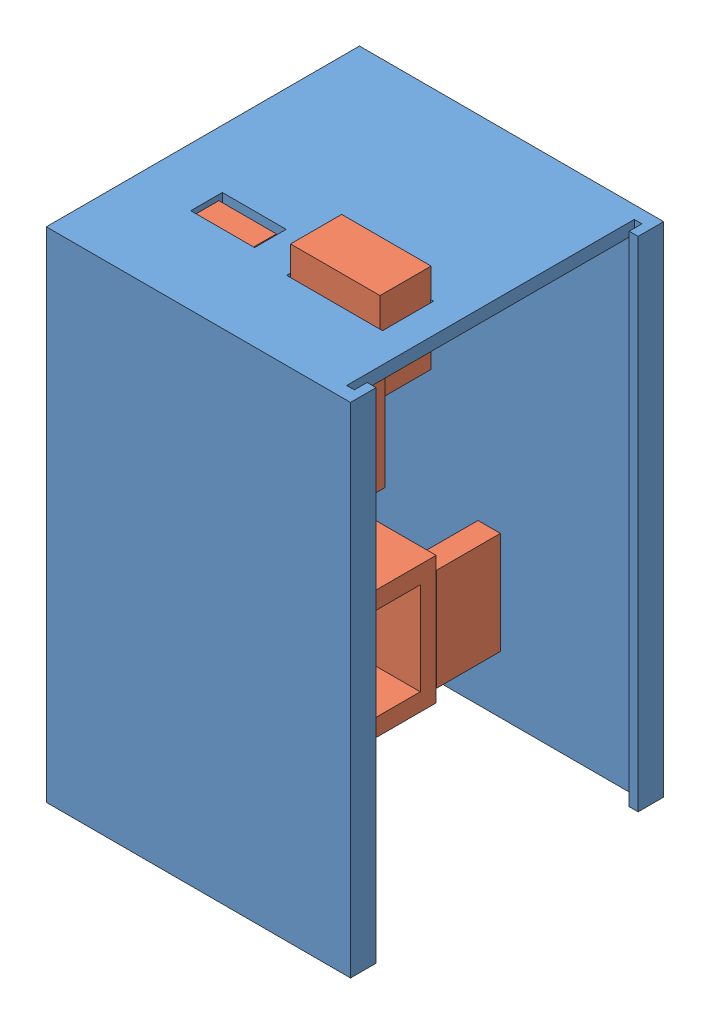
SolidWorks assembly Assem1.SLDASM, configuration Default (file format 7000). Lengths in mm.
Overall size (47.6 82.44 49).
2 component instances, 2 part files, 3 mates.
Components (placement in the parent):
- main cover1-1: main cover1.SLDPRT [Default] at (9.884 65.8024 52.9689) size (47.6 78 49)
- Main board-1: Main board.SLDPRT [Default] at (9.0283 29.426 71.1181) x (-1 0 0) z (0 -1 0) size (39 25 74.81)
Mates (geometry in assembly coordinates):
- Parallel4: parallel anti-aligned: plane of main cover1-1 through (32.584 -12.1976 75.4689) normal (0 0 -1); plane of Main board-1 through (9.0283 29.426 71.1181) normal (0 0 1)
- Parallel5: parallel aligned: plane of main cover1-1 through (9.884 -12.1976 52.9689) normal (0 -1 0); plane of Main board-1 through (28.5283 -4.574 69.6181) normal (0 -1 0)
- Parallel6: parallel anti-aligned: plane of main cover1-1 through (26.7674 65.8024 65.2454) normal (0 0 -1); plane of Main board-1 through (9.0283 29.426 65.1181) normal (0 0 1)
